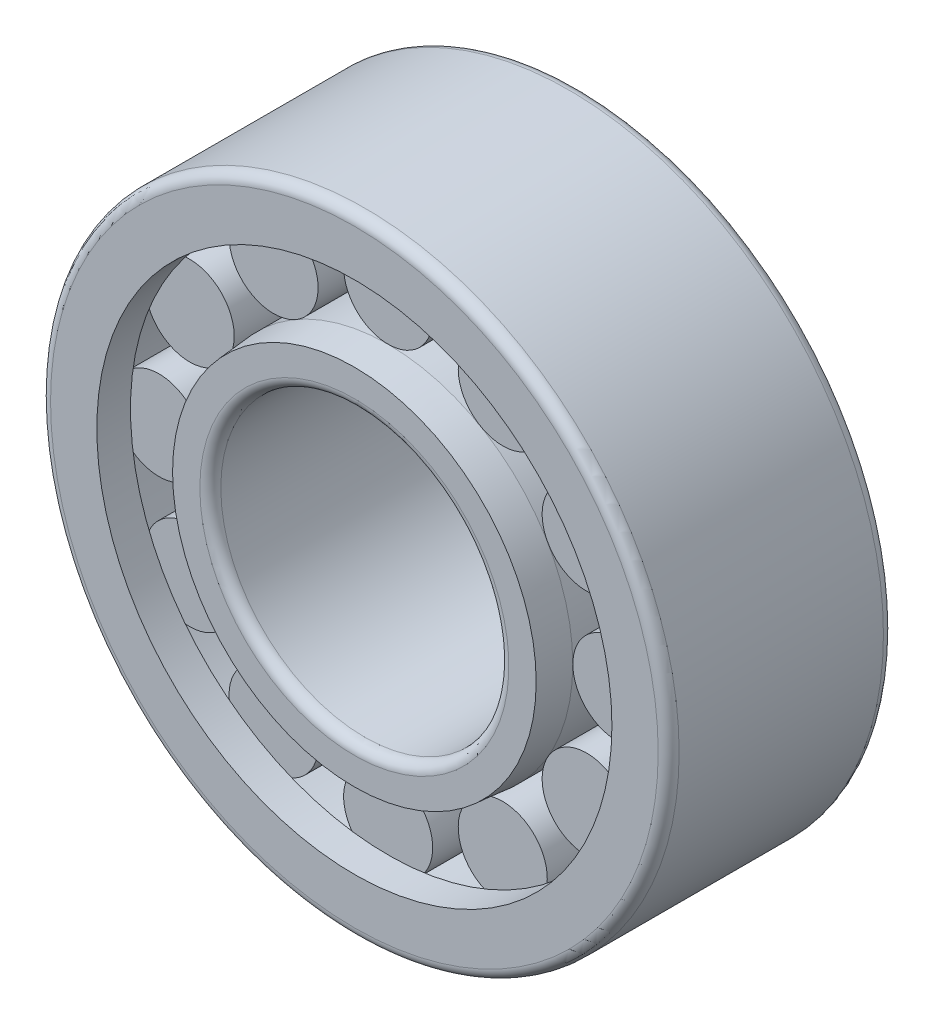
from build123d import *

# Parameters (mm, degrees)
BASESKE_W            = 30.1
BASESKE_H            = 8.5
FILLET1_R            = 2
CIRPATTERNBALL_COUNT = 12


with BuildPart() as part:
    # BaseSke → Roller (revolve)
    with BuildSketch(Plane(origin=(0, 0, 0), x_dir=(0, 0, -1), z_dir=(1, 0, 0))):
        with Locations((0, 39.5)):
            Rectangle(BASESKE_W, BASESKE_H)
    roller = revolve(axis=Axis((0, 43.75, 15.05), (0, 0, -1)))

    # OuterRaceSke → OuterRace (revolve)
    with BuildSketch(Plane(origin=(0, 0, 0), x_dir=(0, 0, -1), z_dir=(1, 0, 0)), mode=Mode.PRIVATE) as outerrace_sk:
        Polygon((-21.5, 60), (21.5, 60), (21.5, 49.166666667), (15.075, 49.166666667), (15.075, 52.23), (-15.075, 52.23), (-15.075, 49.166666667), (-21.5, 49.166666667), align=None)
    revolve(outerrace_sk.sketch.rotate(Axis((0, 0, 50.391616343), (0, 0, -1)), 90), axis=Axis((0, 0, 50.391616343), (0, 0, -1)))

    # InnerRaceSke → InnerRace (revolve)
    with BuildSketch(Plane(origin=(0, 0, 0), x_dir=(0, 0, -1), z_dir=(1, 0, 0)), mode=Mode.PRIVATE) as innerrace_sk:
        Polygon((-21.5, 27.5), (21.5, 27.5), (21.5, 38.333333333), (15.075, 38.333333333), (15.075, 35.27), (-15.075, 35.27), (-15.075, 38.333333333), (-21.5, 38.333333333), align=None)
    revolve(innerrace_sk.sketch.rotate(Axis((0, 0, 70.862590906), (0, 0, -1)), 90), axis=Axis((0, 0, 70.862590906), (0, 0, -1)))

    # Fillet1
    fillet1_edges = [part.edges().sort_by_distance(p)[0] for p in [
        (-60, 0, 21.5),
        (-60, 0, -21.5),
        (-27.5, 0, -21.5),
        (-27.5, 0, 21.5),
    ]]
    fillet(fillet1_edges, radius=FILLET1_R)

    # NJSke → NJ (revolve, cut)
    with BuildSketch(Plane(origin=(0, 0, 0), x_dir=(0, 0, -1), z_dir=(1, 0, 0)), mode=Mode.PRIVATE) as nj_sk:
        Polygon((21.5, 38.333333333), (15.075, 38.333333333), (15.075, 35.27), (21.5, 34.707885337), align=None)
    nj = revolve(nj_sk.sketch.rotate(Axis((0, 0, 35.607790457), (0, 0, -1)), 270), axis=Axis((0, 0, 35.607790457), (0, 0, -1)), mode=Mode.SUBTRACT)

    # NU: NJ across plane
    add(nj.mirror(Plane.XY), mode=Mode.SUBTRACT)

    # CirPatternBall: Roller ×12 about axis
    cirpatternball_axis = Axis((0, 0, 0), (0, 0, 1))
    for i in range(1, CIRPATTERNBALL_COUNT):
        add(roller.rotate(cirpatternball_axis, i * 360 / CIRPATTERNBALL_COUNT))


solid = part.part
